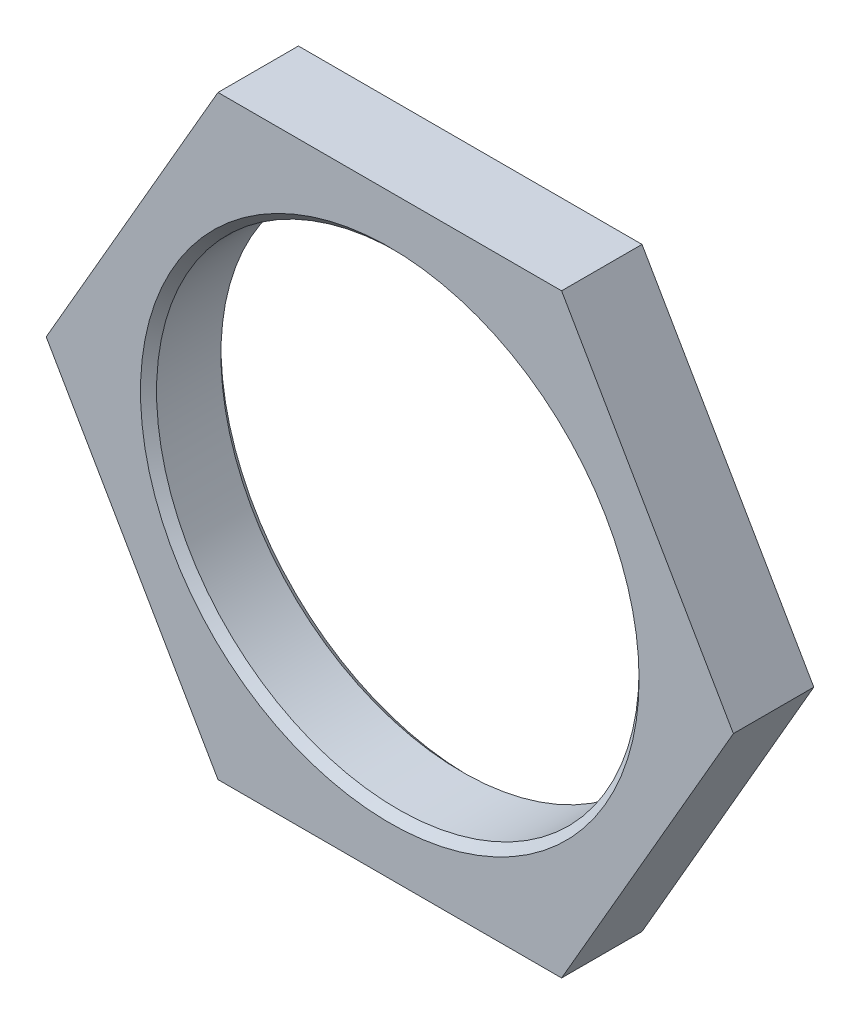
ISO-10303-21;
HEADER;
FILE_DESCRIPTION(('STEP AP214'),'2;1');
FILE_NAME('part.step','',(''),(''),'','','');
FILE_SCHEMA(('AUTOMOTIVE_DESIGN { 1 0 10303 214 1 1 1 1 }'));
ENDSEC;
DATA;
#1=APPLICATION_CONTEXT('core data for automotive mechanical design processes');
#2=APPLICATION_PROTOCOL_DEFINITION('international standard','automotive_design',2000,#1);
#3=PRODUCT_CONTEXT('',#1,'mechanical');
#4=PRODUCT('Part','Part','',(#3));
#5=PRODUCT_RELATED_PRODUCT_CATEGORY('part','',(#4));
#6=PRODUCT_DEFINITION_FORMATION('','',#4);
#7=PRODUCT_DEFINITION_CONTEXT('part definition',#1,'design');
#8=PRODUCT_DEFINITION('design','',#6,#7);
#9=PRODUCT_DEFINITION_SHAPE('','',#8);
#10=(LENGTH_UNIT() NAMED_UNIT(*) SI_UNIT(.MILLI.,.METRE.));
#11=(NAMED_UNIT(*) PLANE_ANGLE_UNIT() SI_UNIT($,.RADIAN.));
#12=(NAMED_UNIT(*) SI_UNIT($,.STERADIAN.) SOLID_ANGLE_UNIT());
#13=UNCERTAINTY_MEASURE_WITH_UNIT(LENGTH_MEASURE(1.E-05),#10,'distance_accuracy_value','');
#14=(GEOMETRIC_REPRESENTATION_CONTEXT(3) GLOBAL_UNCERTAINTY_ASSIGNED_CONTEXT((#13)) GLOBAL_UNIT_ASSIGNED_CONTEXT((#10,
#11,#12)) REPRESENTATION_CONTEXT('',''));
#15=CARTESIAN_POINT('',(0.,0.,0.));
#16=DIRECTION('',(0.,0.,1.));
#17=DIRECTION('',(1.,0.,0.));
#18=AXIS2_PLACEMENT_3D('',#15,#16,#17);
#19=CARTESIAN_POINT('',(4.27239199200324,0.,1.));
#20=DIRECTION('',(-0.866025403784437,0.500000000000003,0.));
#21=DIRECTION('',(-0.500000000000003,-0.866025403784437,0.));
#22=AXIS2_PLACEMENT_3D('',#19,#20,#21);
#23=PLANE('',#22);
#24=DIRECTION('',(0.500000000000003,0.866025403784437,0.));
#25=VECTOR('',#24,1.);
#26=CARTESIAN_POINT('',(4.27239199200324,0.,0.));
#27=LINE('',#26,#25);
#28=CARTESIAN_POINT('',(2.13619599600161,-3.69999999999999,0.));
#29=VERTEX_POINT('',#28);
#30=CARTESIAN_POINT('',(4.27239199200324,0.,0.));
#31=VERTEX_POINT('',#30);
#32=EDGE_CURVE('E116',#29,#31,#27,.T.);
#33=ORIENTED_EDGE('',*,*,#32,.T.);
#34=DIRECTION('',(0.,0.,-1.));
#35=VECTOR('',#34,1.);
#36=CARTESIAN_POINT('',(4.27239199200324,0.,1.));
#37=LINE('',#36,#35);
#38=CARTESIAN_POINT('',(4.27239199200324,0.,1.));
#39=VERTEX_POINT('',#38);
#40=EDGE_CURVE('E133',#39,#31,#37,.T.);
#41=ORIENTED_EDGE('',*,*,#40,.F.);
#42=DIRECTION('',(0.500000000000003,0.866025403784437,0.));
#43=VECTOR('',#42,1.);
#44=CARTESIAN_POINT('',(4.27239199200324,0.,1.));
#45=LINE('',#44,#43);
#46=CARTESIAN_POINT('',(2.13619599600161,-3.69999999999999,1.));
#47=VERTEX_POINT('',#46);
#48=EDGE_CURVE('E126',#47,#39,#45,.T.);
#49=ORIENTED_EDGE('',*,*,#48,.F.);
#50=DIRECTION('',(0.,0.,-1.));
#51=VECTOR('',#50,1.);
#52=CARTESIAN_POINT('',(2.13619599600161,-3.69999999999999,1.));
#53=LINE('',#52,#51);
#54=EDGE_CURVE('E112',#47,#29,#53,.T.);
#55=ORIENTED_EDGE('',*,*,#54,.T.);
#56=EDGE_LOOP('',(#33,#41,#49,#55));
#57=FACE_BOUND('',#56,.T.);
#58=ADVANCED_FACE('F30',(#57),#23,.F.);
#59=CARTESIAN_POINT('',(4.27239199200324,0.,1.));
#60=DIRECTION('',(-0.866025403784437,-0.500000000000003,0.));
#61=DIRECTION('',(0.500000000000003,-0.866025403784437,0.));
#62=AXIS2_PLACEMENT_3D('',#59,#60,#61);
#63=PLANE('',#62);
#64=DIRECTION('',(-0.500000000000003,0.866025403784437,0.));
#65=VECTOR('',#64,1.);
#66=CARTESIAN_POINT('',(4.27239199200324,0.,0.));
#67=LINE('',#66,#65);
#68=CARTESIAN_POINT('',(2.13619599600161,3.69999999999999,0.));
#69=VERTEX_POINT('',#68);
#70=EDGE_CURVE('E119',#31,#69,#67,.T.);
#71=ORIENTED_EDGE('',*,*,#70,.T.);
#72=DIRECTION('',(0.,0.,-1.));
#73=VECTOR('',#72,1.);
#74=CARTESIAN_POINT('',(2.13619599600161,3.69999999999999,1.));
#75=LINE('',#74,#73);
#76=CARTESIAN_POINT('',(2.13619599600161,3.69999999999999,1.));
#77=VERTEX_POINT('',#76);
#78=EDGE_CURVE('E130',#77,#69,#75,.T.);
#79=ORIENTED_EDGE('',*,*,#78,.F.);
#80=DIRECTION('',(-0.500000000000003,0.866025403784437,0.));
#81=VECTOR('',#80,1.);
#82=CARTESIAN_POINT('',(4.27239199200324,0.,1.));
#83=LINE('',#82,#81);
#84=EDGE_CURVE('E85',#39,#77,#83,.T.);
#85=ORIENTED_EDGE('',*,*,#84,.F.);
#86=ORIENTED_EDGE('',*,*,#40,.T.);
#87=EDGE_LOOP('',(#71,#79,#85,#86));
#88=FACE_BOUND('',#87,.T.);
#89=ADVANCED_FACE('F178',(#88),#63,.F.);
#90=CARTESIAN_POINT('',(-2.13619599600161,3.69999999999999,1.));
#91=DIRECTION('',(0.,-1.,0.));
#92=DIRECTION('',(0.,0.,-1.));
#93=AXIS2_PLACEMENT_3D('',#90,#91,#92);
#94=PLANE('',#93);
#95=DIRECTION('',(-1.,0.,0.));
#96=VECTOR('',#95,1.);
#97=CARTESIAN_POINT('',(-2.13619599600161,3.69999999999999,0.));
#98=LINE('',#97,#96);
#99=CARTESIAN_POINT('',(-2.13619599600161,3.69999999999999,0.));
#100=VERTEX_POINT('',#99);
#101=EDGE_CURVE('E121',#69,#100,#98,.T.);
#102=ORIENTED_EDGE('',*,*,#101,.T.);
#103=DIRECTION('',(0.,0.,-1.));
#104=VECTOR('',#103,1.);
#105=CARTESIAN_POINT('',(-2.13619599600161,3.69999999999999,1.));
#106=LINE('',#105,#104);
#107=CARTESIAN_POINT('',(-2.13619599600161,3.69999999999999,1.));
#108=VERTEX_POINT('',#107);
#109=EDGE_CURVE('E107',#108,#100,#106,.T.);
#110=ORIENTED_EDGE('',*,*,#109,.F.);
#111=DIRECTION('',(-1.,0.,0.));
#112=VECTOR('',#111,1.);
#113=CARTESIAN_POINT('',(-2.13619599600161,3.69999999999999,1.));
#114=LINE('',#113,#112);
#115=EDGE_CURVE('E98',#77,#108,#114,.T.);
#116=ORIENTED_EDGE('',*,*,#115,.F.);
#117=ORIENTED_EDGE('',*,*,#78,.T.);
#118=EDGE_LOOP('',(#102,#110,#116,#117));
#119=FACE_BOUND('',#118,.T.);
#120=ADVANCED_FACE('F183',(#119),#94,.F.);
#121=CARTESIAN_POINT('',(-4.27239199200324,0.,1.));
#122=DIRECTION('',(0.866025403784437,-0.500000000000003,0.));
#123=DIRECTION('',(0.500000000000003,0.866025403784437,0.));
#124=AXIS2_PLACEMENT_3D('',#121,#122,#123);
#125=PLANE('',#124);
#126=DIRECTION('',(-0.500000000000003,-0.866025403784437,0.));
#127=VECTOR('',#126,1.);
#128=CARTESIAN_POINT('',(-4.27239199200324,0.,0.));
#129=LINE('',#128,#127);
#130=CARTESIAN_POINT('',(-4.27239199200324,0.,0.));
#131=VERTEX_POINT('',#130);
#132=EDGE_CURVE('E106',#100,#131,#129,.T.);
#133=ORIENTED_EDGE('',*,*,#132,.T.);
#134=DIRECTION('',(0.,0.,-1.));
#135=VECTOR('',#134,1.);
#136=CARTESIAN_POINT('',(-4.27239199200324,0.,1.));
#137=LINE('',#136,#135);
#138=CARTESIAN_POINT('',(-4.27239199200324,0.,1.));
#139=VERTEX_POINT('',#138);
#140=EDGE_CURVE('E103',#139,#131,#137,.T.);
#141=ORIENTED_EDGE('',*,*,#140,.F.);
#142=DIRECTION('',(-0.500000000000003,-0.866025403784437,0.));
#143=VECTOR('',#142,1.);
#144=CARTESIAN_POINT('',(-4.27239199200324,0.,1.));
#145=LINE('',#144,#143);
#146=EDGE_CURVE('E92',#108,#139,#145,.T.);
#147=ORIENTED_EDGE('',*,*,#146,.F.);
#148=ORIENTED_EDGE('',*,*,#109,.T.);
#149=EDGE_LOOP('',(#133,#141,#147,#148));
#150=FACE_BOUND('',#149,.T.);
#151=ADVANCED_FACE('F104',(#150),#125,.F.);
#152=CARTESIAN_POINT('',(-4.27239199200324,0.,1.));
#153=DIRECTION('',(0.866025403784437,0.500000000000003,0.));
#154=DIRECTION('',(-0.500000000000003,0.866025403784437,0.));
#155=AXIS2_PLACEMENT_3D('',#152,#153,#154);
#156=PLANE('',#155);
#157=DIRECTION('',(0.500000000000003,-0.866025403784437,0.));
#158=VECTOR('',#157,1.);
#159=CARTESIAN_POINT('',(-4.27239199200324,0.,0.));
#160=LINE('',#159,#158);
#161=CARTESIAN_POINT('',(-2.13619599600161,-3.69999999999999,0.));
#162=VERTEX_POINT('',#161);
#163=EDGE_CURVE('E70',#131,#162,#160,.T.);
#164=ORIENTED_EDGE('',*,*,#163,.T.);
#165=DIRECTION('',(0.,0.,-1.));
#166=VECTOR('',#165,1.);
#167=CARTESIAN_POINT('',(-2.13619599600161,-3.69999999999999,1.));
#168=LINE('',#167,#166);
#169=CARTESIAN_POINT('',(-2.13619599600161,-3.69999999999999,1.));
#170=VERTEX_POINT('',#169);
#171=EDGE_CURVE('E108',#170,#162,#168,.T.);
#172=ORIENTED_EDGE('',*,*,#171,.F.);
#173=DIRECTION('',(0.500000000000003,-0.866025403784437,0.));
#174=VECTOR('',#173,1.);
#175=CARTESIAN_POINT('',(-4.27239199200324,0.,1.));
#176=LINE('',#175,#174);
#177=EDGE_CURVE('E96',#139,#170,#176,.T.);
#178=ORIENTED_EDGE('',*,*,#177,.F.);
#179=ORIENTED_EDGE('',*,*,#140,.T.);
#180=EDGE_LOOP('',(#164,#172,#178,#179));
#181=FACE_BOUND('',#180,.T.);
#182=ADVANCED_FACE('F110',(#181),#156,.F.);
#183=CARTESIAN_POINT('',(-2.13619599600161,-3.69999999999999,1.));
#184=DIRECTION('',(0.,1.,0.));
#185=DIRECTION('',(0.,0.,1.));
#186=AXIS2_PLACEMENT_3D('',#183,#184,#185);
#187=PLANE('',#186);
#188=DIRECTION('',(1.,0.,0.));
#189=VECTOR('',#188,1.);
#190=CARTESIAN_POINT('',(-2.13619599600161,-3.69999999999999,0.));
#191=LINE('',#190,#189);
#192=EDGE_CURVE('E76',#162,#29,#191,.T.);
#193=ORIENTED_EDGE('',*,*,#192,.T.);
#194=ORIENTED_EDGE('',*,*,#54,.F.);
#195=DIRECTION('',(1.,0.,0.));
#196=VECTOR('',#195,1.);
#197=CARTESIAN_POINT('',(-2.13619599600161,-3.69999999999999,1.));
#198=LINE('',#197,#196);
#199=EDGE_CURVE('E47',#170,#47,#198,.T.);
#200=ORIENTED_EDGE('',*,*,#199,.F.);
#201=ORIENTED_EDGE('',*,*,#171,.T.);
#202=EDGE_LOOP('',(#193,#194,#200,#201));
#203=FACE_BOUND('',#202,.T.);
#204=ADVANCED_FACE('F168',(#203),#187,.F.);
#205=CARTESIAN_POINT('',(0.,-7.39999999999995,1.));
#206=DIRECTION('',(0.,0.,1.));
#207=DIRECTION('',(1.,0.,0.));
#208=AXIS2_PLACEMENT_3D('',#205,#206,#207);
#209=PLANE('',#208);
#210=CARTESIAN_POINT('',(0.,0.,1.));
#211=DIRECTION('',(0.,0.,1.));
#212=DIRECTION('',(1.,0.,0.));
#213=AXIS2_PLACEMENT_3D('',#210,#211,#212);
#214=CIRCLE('',#213,3.1);
#215=CARTESIAN_POINT('',(3.1,0.,1.));
#216=VERTEX_POINT('',#215);
#217=EDGE_CURVE('E39',#216,#216,#214,.F.);
#218=ORIENTED_EDGE('',*,*,#217,.T.);
#219=EDGE_LOOP('',(#218));
#220=FACE_BOUND('',#219,.T.);
#221=ORIENTED_EDGE('',*,*,#48,.T.);
#222=ORIENTED_EDGE('',*,*,#84,.T.);
#223=ORIENTED_EDGE('',*,*,#115,.T.);
#224=ORIENTED_EDGE('',*,*,#146,.T.);
#225=ORIENTED_EDGE('',*,*,#177,.T.);
#226=ORIENTED_EDGE('',*,*,#199,.T.);
#227=EDGE_LOOP('',(#221,#222,#223,#224,#225,#226));
#228=FACE_BOUND('',#227,.T.);
#229=ADVANCED_FACE('F94',(#220,#228),#209,.T.);
#230=CARTESIAN_POINT('',(0.,-7.39999999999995,0.));
#231=DIRECTION('',(0.,0.,1.));
#232=DIRECTION('',(1.,0.,0.));
#233=AXIS2_PLACEMENT_3D('',#230,#231,#232);
#234=PLANE('',#233);
#235=CARTESIAN_POINT('',(0.,0.,0.));
#236=DIRECTION('',(0.,0.,1.));
#237=DIRECTION('',(1.,0.,0.));
#238=AXIS2_PLACEMENT_3D('',#235,#236,#237);
#239=CIRCLE('',#238,3.1);
#240=CARTESIAN_POINT('',(3.1,0.,0.));
#241=VERTEX_POINT('',#240);
#242=EDGE_CURVE('E11',#241,#241,#239,.T.);
#243=ORIENTED_EDGE('',*,*,#242,.T.);
#244=EDGE_LOOP('',(#243));
#245=FACE_BOUND('',#244,.T.);
#246=ORIENTED_EDGE('',*,*,#32,.F.);
#247=ORIENTED_EDGE('',*,*,#192,.F.);
#248=ORIENTED_EDGE('',*,*,#163,.F.);
#249=ORIENTED_EDGE('',*,*,#132,.F.);
#250=ORIENTED_EDGE('',*,*,#101,.F.);
#251=ORIENTED_EDGE('',*,*,#70,.F.);
#252=EDGE_LOOP('',(#246,#247,#248,#249,#250,#251));
#253=FACE_BOUND('',#252,.T.);
#254=ADVANCED_FACE('F152',(#245,#253),#234,.F.);
#255=CARTESIAN_POINT('',(0.,0.,0.));
#256=DIRECTION('',(0.,0.,1.));
#257=DIRECTION('',(1.,0.,0.));
#258=AXIS2_PLACEMENT_3D('',#255,#256,#257);
#259=CYLINDRICAL_SURFACE('',#258,3.);
#260=CARTESIAN_POINT('',(0.,0.,0.899999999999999));
#261=DIRECTION('',(0.,0.,1.));
#262=DIRECTION('',(1.,0.,0.));
#263=AXIS2_PLACEMENT_3D('',#260,#261,#262);
#264=CIRCLE('',#263,3.);
#265=CARTESIAN_POINT('',(3.,0.,0.899999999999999));
#266=VERTEX_POINT('',#265);
#267=EDGE_CURVE('E138',#266,#266,#264,.T.);
#268=ORIENTED_EDGE('',*,*,#267,.T.);
#269=EDGE_LOOP('',(#268));
#270=FACE_BOUND('',#269,.T.);
#271=CARTESIAN_POINT('',(0.,0.,0.100000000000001));
#272=DIRECTION('',(0.,0.,1.));
#273=DIRECTION('',(1.,0.,0.));
#274=AXIS2_PLACEMENT_3D('',#271,#272,#273);
#275=CIRCLE('',#274,3.);
#276=CARTESIAN_POINT('',(3.,0.,0.100000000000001));
#277=VERTEX_POINT('',#276);
#278=EDGE_CURVE('E135',#277,#277,#275,.F.);
#279=ORIENTED_EDGE('',*,*,#278,.T.);
#280=EDGE_LOOP('',(#279));
#281=FACE_BOUND('',#280,.T.);
#282=ADVANCED_FACE('F147',(#270,#281),#259,.F.);
#283=CARTESIAN_POINT('',(0.,0.,0.899999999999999));
#284=DIRECTION('',(0.,0.,1.));
#285=DIRECTION('',(1.,0.,0.));
#286=AXIS2_PLACEMENT_3D('',#283,#284,#285);
#287=CONICAL_SURFACE('',#286,3.,0.785398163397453);
#288=ORIENTED_EDGE('',*,*,#217,.F.);
#289=EDGE_LOOP('',(#288));
#290=FACE_BOUND('',#289,.T.);
#291=ORIENTED_EDGE('',*,*,#267,.F.);
#292=EDGE_LOOP('',(#291));
#293=FACE_BOUND('',#292,.T.);
#294=ADVANCED_FACE('F144',(#290,#293),#287,.F.);
#295=CARTESIAN_POINT('',(0.,0.,0.));
#296=DIRECTION('',(0.,0.,-1.));
#297=DIRECTION('',(-1.,0.,0.));
#298=AXIS2_PLACEMENT_3D('',#295,#296,#297);
#299=CONICAL_SURFACE('',#298,3.1,0.785398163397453);
#300=ORIENTED_EDGE('',*,*,#278,.F.);
#301=EDGE_LOOP('',(#300));
#302=FACE_BOUND('',#301,.T.);
#303=ORIENTED_EDGE('',*,*,#242,.F.);
#304=EDGE_LOOP('',(#303));
#305=FACE_BOUND('',#304,.T.);
#306=ADVANCED_FACE('F32',(#302,#305),#299,.F.);
#307=CLOSED_SHELL('',(#58,#89,#120,#151,#182,#204,#229,#254,#282,#294,#306));
#308=MANIFOLD_SOLID_BREP('B2',#307);
#309=ADVANCED_BREP_SHAPE_REPRESENTATION('',(#18,#308),#14);
#310=SHAPE_DEFINITION_REPRESENTATION(#9,#309);
ENDSEC;
END-ISO-10303-21;
